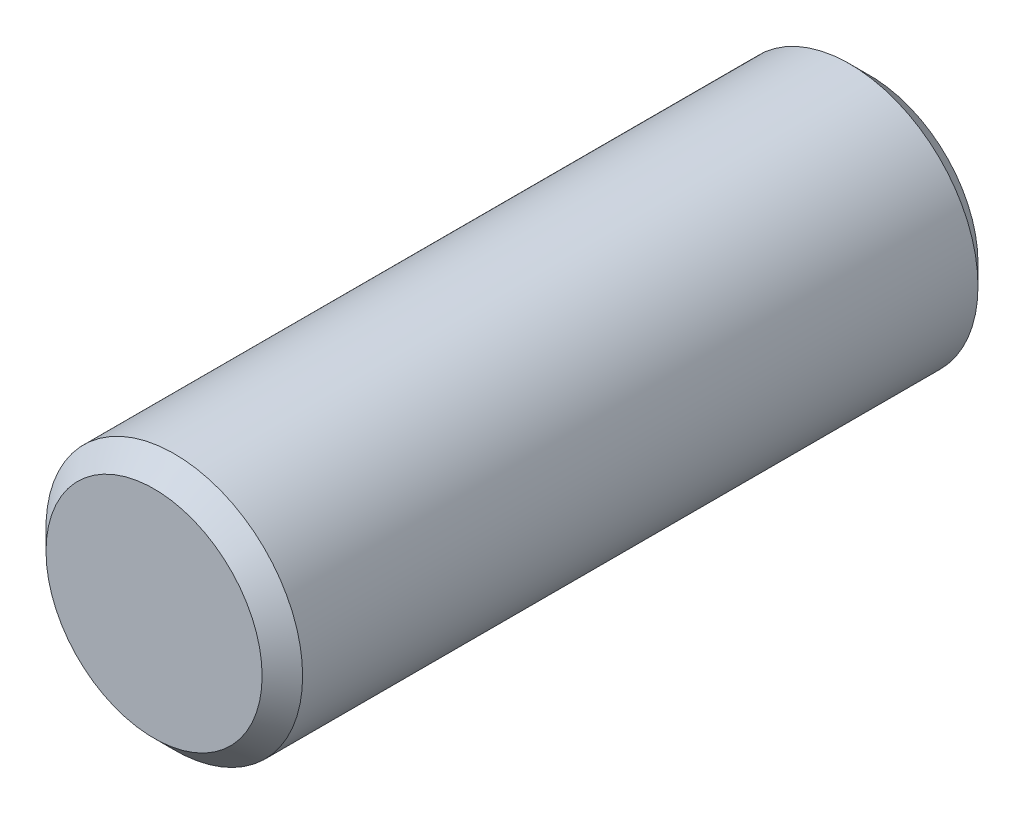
from build123d import *

# Parameters (mm, degrees)
SKETCH1_R               = 4.826
BOSS_EXTRUDE1_DEPTH     = 13.462
CHAMFER1_SIZE           = 0.762
CUT_EXTRUDE1_DEPTH      = 16.093243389
CUT_EXTRUDE1_DEPTH_BACK = 16.093243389
SKETCH2_W               = 5.08
SKETCH2_H               = 1.882977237


with BuildPart() as part:
    # Sketch1 → Boss-Extrude1 (new, symmetric)
    with BuildSketch(Plane.XY):
        Circle(SKETCH1_R)
    extrude(amount=BOSS_EXTRUDE1_DEPTH, both=True)

    # Chamfer1
    chamfer1_edges = [part.edges().sort_by_distance(p)[0] for p in [
        (-4.826, 0, -13.462),
        (-4.826, 0, 13.462),
    ]]
    chamfer(chamfer1_edges, length=CHAMFER1_SIZE)

    # Sketch2 → Cut-Extrude1 (cut, two sides: drawn at the far end of the back side and taken through both)
    with BuildSketch(Plane(origin=(0, 0, 0), x_dir=(0, 0, -1), z_dir=(1, 0, 0)).offset(-CUT_EXTRUDE1_DEPTH_BACK)):
        with Locations((7.112, -4.751488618)):
            Rectangle(SKETCH2_W, SKETCH2_H)
    extrude(amount=CUT_EXTRUDE1_DEPTH + CUT_EXTRUDE1_DEPTH_BACK, mode=Mode.SUBTRACT)


solid = part.part
